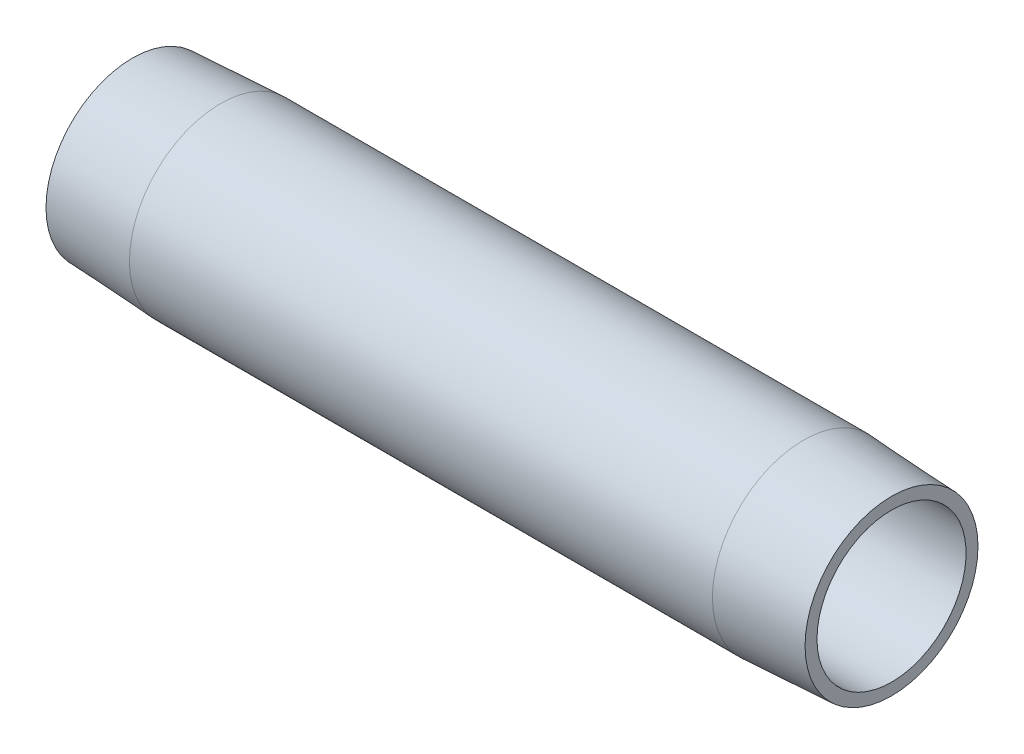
from build123d import *


with BuildPart() as part:
    # Sketch1 → Revolve1 (revolve)
    with BuildSketch(Plane.XY, mode=Mode.PRIVATE) as revolve1_sk:
        Polygon((88.9, 8.73125), (0, 8.73125), (0, 10.127550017), (10.3124, 10.668), (78.5876, 10.668), (88.9, 10.127550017), align=None)
    revolve(revolve1_sk.sketch.rotate(Axis((0, 0, 0), (1, 0, 0)), 90), axis=Axis((0, 0, 0), (1, 0, 0)))


solid = part.part
